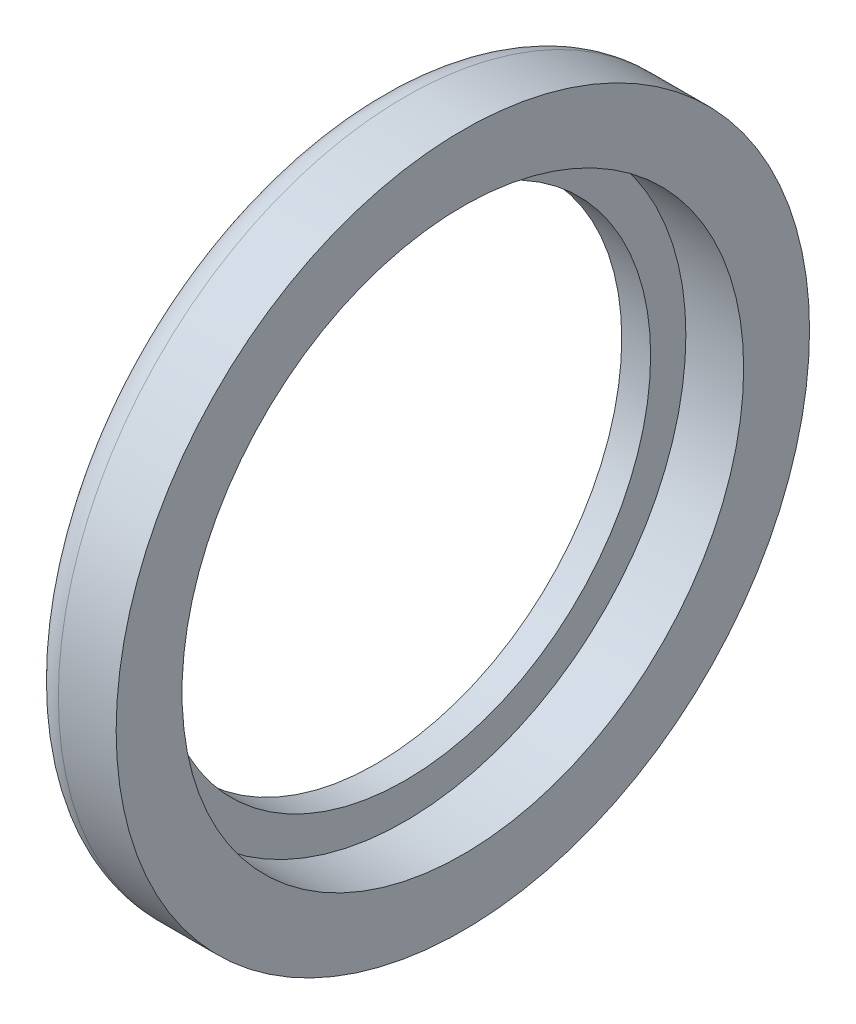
ISO-10303-21;
HEADER;
FILE_DESCRIPTION(('STEP AP214'),'2;1');
FILE_NAME('part.step','',(''),(''),'','','');
FILE_SCHEMA(('AUTOMOTIVE_DESIGN { 1 0 10303 214 1 1 1 1 }'));
ENDSEC;
DATA;
#1=APPLICATION_CONTEXT('core data for automotive mechanical design processes');
#2=APPLICATION_PROTOCOL_DEFINITION('international standard','automotive_design',2000,#1);
#3=PRODUCT_CONTEXT('',#1,'mechanical');
#4=PRODUCT('Part','Part','',(#3));
#5=PRODUCT_RELATED_PRODUCT_CATEGORY('part','',(#4));
#6=PRODUCT_DEFINITION_FORMATION('','',#4);
#7=PRODUCT_DEFINITION_CONTEXT('part definition',#1,'design');
#8=PRODUCT_DEFINITION('design','',#6,#7);
#9=PRODUCT_DEFINITION_SHAPE('','',#8);
#10=(LENGTH_UNIT() NAMED_UNIT(*) SI_UNIT(.MILLI.,.METRE.));
#11=(NAMED_UNIT(*) PLANE_ANGLE_UNIT() SI_UNIT($,.RADIAN.));
#12=(NAMED_UNIT(*) SI_UNIT($,.STERADIAN.) SOLID_ANGLE_UNIT());
#13=UNCERTAINTY_MEASURE_WITH_UNIT(LENGTH_MEASURE(1.E-05),#10,'distance_accuracy_value','');
#14=(GEOMETRIC_REPRESENTATION_CONTEXT(3) GLOBAL_UNCERTAINTY_ASSIGNED_CONTEXT((#13)) GLOBAL_UNIT_ASSIGNED_CONTEXT((#10,
#11,#12)) REPRESENTATION_CONTEXT('',''));
#15=CARTESIAN_POINT('',(0.,0.,0.));
#16=DIRECTION('',(0.,0.,1.));
#17=DIRECTION('',(1.,0.,0.));
#18=AXIS2_PLACEMENT_3D('',#15,#16,#17);
#19=CARTESIAN_POINT('',(0.,30.861,0.));
#20=DIRECTION('',(1.,0.,0.));
#21=DIRECTION('',(0.,0.,-1.));
#22=AXIS2_PLACEMENT_3D('',#19,#20,#21);
#23=PLANE('',#22);
#24=CARTESIAN_POINT('',(0.,0.,0.));
#25=DIRECTION('',(1.,0.,0.));
#26=DIRECTION('',(0.,0.,-1.));
#27=AXIS2_PLACEMENT_3D('',#24,#25,#26);
#28=CIRCLE('',#27,38.1);
#29=CARTESIAN_POINT('',(0.,0.,-38.1));
#30=VERTEX_POINT('',#29);
#31=EDGE_CURVE('E50',#30,#30,#28,.T.);
#32=ORIENTED_EDGE('',*,*,#31,.T.);
#33=EDGE_LOOP('',(#32));
#34=FACE_BOUND('',#33,.T.);
#35=CARTESIAN_POINT('',(0.,0.,0.));
#36=DIRECTION('',(1.,0.,0.));
#37=DIRECTION('',(0.,0.,-1.));
#38=AXIS2_PLACEMENT_3D('',#35,#36,#37);
#39=CIRCLE('',#38,30.861);
#40=CARTESIAN_POINT('',(0.,0.,-30.861));
#41=VERTEX_POINT('',#40);
#42=EDGE_CURVE('E65',#41,#41,#39,.T.);
#43=ORIENTED_EDGE('',*,*,#42,.F.);
#44=EDGE_LOOP('',(#43));
#45=FACE_BOUND('',#44,.T.);
#46=ADVANCED_FACE('F39',(#34,#45),#23,.T.);
#47=CARTESIAN_POINT('',(0.,0.,0.));
#48=DIRECTION('',(1.,0.,0.));
#49=DIRECTION('',(0.,0.,-1.));
#50=AXIS2_PLACEMENT_3D('',#47,#48,#49);
#51=CYLINDRICAL_SURFACE('',#50,38.1);
#52=CARTESIAN_POINT('',(-6.35,0.,0.));
#53=DIRECTION('',(-1.,0.,0.));
#54=DIRECTION('',(0.,0.,1.));
#55=AXIS2_PLACEMENT_3D('',#52,#53,#54);
#56=CIRCLE('',#55,38.1);
#57=CARTESIAN_POINT('',(-6.35,0.,38.1));
#58=VERTEX_POINT('',#57);
#59=EDGE_CURVE('E46',#58,#58,#56,.F.);
#60=ORIENTED_EDGE('',*,*,#59,.T.);
#61=EDGE_LOOP('',(#60));
#62=FACE_BOUND('',#61,.T.);
#63=ORIENTED_EDGE('',*,*,#31,.F.);
#64=EDGE_LOOP('',(#63));
#65=FACE_BOUND('',#64,.T.);
#66=ADVANCED_FACE('F73',(#62,#65),#51,.T.);
#67=CARTESIAN_POINT('',(-9.525,38.1,0.));
#68=DIRECTION('',(-1.,0.,0.));
#69=DIRECTION('',(0.,0.,1.));
#70=AXIS2_PLACEMENT_3D('',#67,#68,#69);
#71=PLANE('',#70);
#72=CARTESIAN_POINT('',(-9.525,0.,0.));
#73=DIRECTION('',(-1.,0.,0.));
#74=DIRECTION('',(0.,0.,1.));
#75=AXIS2_PLACEMENT_3D('',#72,#73,#74);
#76=CIRCLE('',#75,34.925);
#77=CARTESIAN_POINT('',(-9.525,0.,34.925));
#78=VERTEX_POINT('',#77);
#79=EDGE_CURVE('E10',#78,#78,#76,.T.);
#80=ORIENTED_EDGE('',*,*,#79,.T.);
#81=EDGE_LOOP('',(#80));
#82=FACE_BOUND('',#81,.T.);
#83=CARTESIAN_POINT('',(-9.525,0.,0.));
#84=DIRECTION('',(1.,0.,0.));
#85=DIRECTION('',(0.,0.,-1.));
#86=AXIS2_PLACEMENT_3D('',#83,#84,#85);
#87=CIRCLE('',#86,26.9875);
#88=CARTESIAN_POINT('',(-9.525,0.,-26.9875));
#89=VERTEX_POINT('',#88);
#90=EDGE_CURVE('E54',#89,#89,#87,.T.);
#91=ORIENTED_EDGE('',*,*,#90,.T.);
#92=EDGE_LOOP('',(#91));
#93=FACE_BOUND('',#92,.T.);
#94=ADVANCED_FACE('F78',(#82,#93),#71,.T.);
#95=CARTESIAN_POINT('',(0.,0.,0.));
#96=DIRECTION('',(1.,0.,0.));
#97=DIRECTION('',(0.,0.,-1.));
#98=AXIS2_PLACEMENT_3D('',#95,#96,#97);
#99=CYLINDRICAL_SURFACE('',#98,26.9875);
#100=CARTESIAN_POINT('',(-6.35,0.,0.));
#101=DIRECTION('',(1.,0.,0.));
#102=DIRECTION('',(0.,0.,-1.));
#103=AXIS2_PLACEMENT_3D('',#100,#101,#102);
#104=CIRCLE('',#103,26.9875);
#105=CARTESIAN_POINT('',(-6.35,0.,-26.9875));
#106=VERTEX_POINT('',#105);
#107=EDGE_CURVE('E59',#106,#106,#104,.T.);
#108=ORIENTED_EDGE('',*,*,#107,.T.);
#109=EDGE_LOOP('',(#108));
#110=FACE_BOUND('',#109,.T.);
#111=ORIENTED_EDGE('',*,*,#90,.F.);
#112=EDGE_LOOP('',(#111));
#113=FACE_BOUND('',#112,.T.);
#114=ADVANCED_FACE('F83',(#110,#113),#99,.F.);
#115=CARTESIAN_POINT('',(-6.35,26.9875,0.));
#116=DIRECTION('',(1.,0.,0.));
#117=DIRECTION('',(0.,0.,-1.));
#118=AXIS2_PLACEMENT_3D('',#115,#116,#117);
#119=PLANE('',#118);
#120=CARTESIAN_POINT('',(-6.35,0.,0.));
#121=DIRECTION('',(1.,0.,0.));
#122=DIRECTION('',(0.,0.,-1.));
#123=AXIS2_PLACEMENT_3D('',#120,#121,#122);
#124=CIRCLE('',#123,30.861);
#125=CARTESIAN_POINT('',(-6.35,0.,-30.861));
#126=VERTEX_POINT('',#125);
#127=EDGE_CURVE('E62',#126,#126,#124,.T.);
#128=ORIENTED_EDGE('',*,*,#127,.T.);
#129=EDGE_LOOP('',(#128));
#130=FACE_BOUND('',#129,.T.);
#131=ORIENTED_EDGE('',*,*,#107,.F.);
#132=EDGE_LOOP('',(#131));
#133=FACE_BOUND('',#132,.T.);
#134=ADVANCED_FACE('F86',(#130,#133),#119,.T.);
#135=CARTESIAN_POINT('',(0.,0.,0.));
#136=DIRECTION('',(1.,0.,0.));
#137=DIRECTION('',(0.,0.,-1.));
#138=AXIS2_PLACEMENT_3D('',#135,#136,#137);
#139=CYLINDRICAL_SURFACE('',#138,30.861);
#140=ORIENTED_EDGE('',*,*,#42,.T.);
#141=EDGE_LOOP('',(#140));
#142=FACE_BOUND('',#141,.T.);
#143=ORIENTED_EDGE('',*,*,#127,.F.);
#144=EDGE_LOOP('',(#143));
#145=FACE_BOUND('',#144,.T.);
#146=ADVANCED_FACE('F69',(#142,#145),#139,.F.);
#147=CARTESIAN_POINT('',(-6.35,0.,0.));
#148=DIRECTION('',(-1.,0.,0.));
#149=DIRECTION('',(0.,0.,1.));
#150=AXIS2_PLACEMENT_3D('',#147,#148,#149);
#151=TOROIDAL_SURFACE('',#150,34.925,3.175);
#152=ORIENTED_EDGE('',*,*,#79,.F.);
#153=EDGE_LOOP('',(#152));
#154=FACE_BOUND('',#153,.T.);
#155=ORIENTED_EDGE('',*,*,#59,.F.);
#156=EDGE_LOOP('',(#155));
#157=FACE_BOUND('',#156,.T.);
#158=ADVANCED_FACE('F41',(#154,#157),#151,.T.);
#159=CLOSED_SHELL('',(#46,#66,#94,#114,#134,#146,#158));
#160=MANIFOLD_SOLID_BREP('B2',#159);
#161=ADVANCED_BREP_SHAPE_REPRESENTATION('',(#18,#160),#14);
#162=SHAPE_DEFINITION_REPRESENTATION(#9,#161);
ENDSEC;
END-ISO-10303-21;
